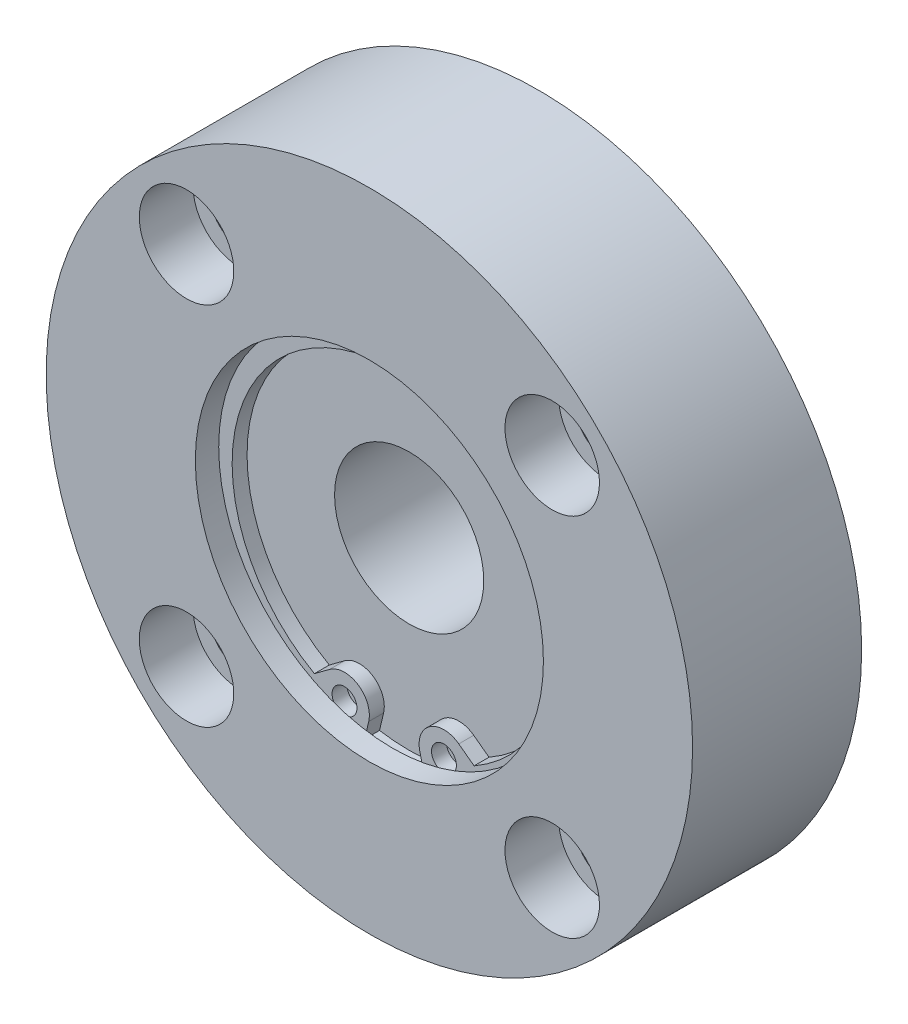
ISO-10303-21;
HEADER;
FILE_DESCRIPTION(('STEP AP214'),'2;1');
FILE_NAME('part.step','',(''),(''),'','','');
FILE_SCHEMA(('AUTOMOTIVE_DESIGN { 1 0 10303 214 1 1 1 1 }'));
ENDSEC;
DATA;
#1=APPLICATION_CONTEXT('core data for automotive mechanical design processes');
#2=APPLICATION_PROTOCOL_DEFINITION('international standard','automotive_design',2000,#1);
#3=PRODUCT_CONTEXT('',#1,'mechanical');
#4=PRODUCT('Part','Part','',(#3));
#5=PRODUCT_RELATED_PRODUCT_CATEGORY('part','',(#4));
#6=PRODUCT_DEFINITION_FORMATION('','',#4);
#7=PRODUCT_DEFINITION_CONTEXT('part definition',#1,'design');
#8=PRODUCT_DEFINITION('design','',#6,#7);
#9=PRODUCT_DEFINITION_SHAPE('','',#8);
#10=(LENGTH_UNIT() NAMED_UNIT(*) SI_UNIT(.MILLI.,.METRE.));
#11=(NAMED_UNIT(*) PLANE_ANGLE_UNIT() SI_UNIT($,.RADIAN.));
#12=(NAMED_UNIT(*) SI_UNIT($,.STERADIAN.) SOLID_ANGLE_UNIT());
#13=UNCERTAINTY_MEASURE_WITH_UNIT(LENGTH_MEASURE(1.E-05),#10,'distance_accuracy_value','');
#14=(GEOMETRIC_REPRESENTATION_CONTEXT(3) GLOBAL_UNCERTAINTY_ASSIGNED_CONTEXT((#13)) GLOBAL_UNIT_ASSIGNED_CONTEXT((#10,
#11,#12)) REPRESENTATION_CONTEXT('',''));
#15=CARTESIAN_POINT('',(0.,0.,0.));
#16=DIRECTION('',(0.,0.,1.));
#17=DIRECTION('',(1.,0.,0.));
#18=AXIS2_PLACEMENT_3D('',#15,#16,#17);
#19=CARTESIAN_POINT('',(2.5678231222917,-16.526983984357,14.6));
#20=DIRECTION('',(0.972870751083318,0.231349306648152,0.));
#21=DIRECTION('',(0.,0.,-1.));
#22=AXIS2_PLACEMENT_3D('',#19,#20,#21);
#23=PLANE('',#22);
#24=DIRECTION('',(0.231349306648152,-0.972870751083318,0.));
#25=VECTOR('',#24,1.);
#26=CARTESIAN_POINT('',(2.5678231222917,-16.526983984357,13.));
#27=LINE('',#26,#25);
#28=CARTESIAN_POINT('',(2.5678231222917,-16.526983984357,13.));
#29=VERTEX_POINT('',#28);
#30=CARTESIAN_POINT('',(2.97957431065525,-18.2584812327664,13.));
#31=VERTEX_POINT('',#30);
#32=EDGE_CURVE('E28',#29,#31,#27,.T.);
#33=ORIENTED_EDGE('',*,*,#32,.T.);
#34=DIRECTION('',(0.,0.,-1.));
#35=VECTOR('',#34,1.);
#36=CARTESIAN_POINT('',(2.97957431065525,-18.2584812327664,14.65));
#37=LINE('',#36,#35);
#38=CARTESIAN_POINT('',(2.97957431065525,-18.2584812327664,14.5));
#39=VERTEX_POINT('',#38);
#40=EDGE_CURVE('E9',#31,#39,#37,.F.);
#41=ORIENTED_EDGE('',*,*,#40,.T.);
#42=DIRECTION('',(0.231349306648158,-0.972870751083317,0.));
#43=VECTOR('',#42,1.);
#44=CARTESIAN_POINT('',(2.56782312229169,-16.526983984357,14.5));
#45=LINE('',#44,#43);
#46=CARTESIAN_POINT('',(2.56782312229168,-16.526983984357,14.5));
#47=VERTEX_POINT('',#46);
#48=EDGE_CURVE('E239',#47,#39,#45,.T.);
#49=ORIENTED_EDGE('',*,*,#48,.F.);
#50=DIRECTION('',(0.,0.,-1.));
#51=VECTOR('',#50,1.);
#52=CARTESIAN_POINT('',(2.5678231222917,-16.526983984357,14.6));
#53=LINE('',#52,#51);
#54=EDGE_CURVE('E129',#47,#29,#53,.T.);
#55=ORIENTED_EDGE('',*,*,#54,.T.);
#56=EDGE_LOOP('',(#33,#41,#49,#55));
#57=FACE_BOUND('',#56,.T.);
#58=ADVANCED_FACE('F14',(#57),#23,.F.);
#59=CARTESIAN_POINT('',(5.,-15.9486107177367,14.6));
#60=DIRECTION('',(0.,0.,1.));
#61=DIRECTION('',(-1.,0.,0.));
#62=AXIS2_PLACEMENT_3D('',#59,#60,#61);
#63=CYLINDRICAL_SURFACE('',#62,2.5);
#64=ORIENTED_EDGE('',*,*,#54,.F.);
#65=CARTESIAN_POINT('',(5.,-15.9486107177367,14.5));
#66=DIRECTION('',(0.,0.,1.));
#67=DIRECTION('',(1.,0.,0.));
#68=AXIS2_PLACEMENT_3D('',#65,#66,#67);
#69=CIRCLE('',#68,2.5);
#70=CARTESIAN_POINT('',(6.49138441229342,-13.9421779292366,14.5));
#71=VERTEX_POINT('',#70);
#72=EDGE_CURVE('E243',#71,#47,#69,.T.);
#73=ORIENTED_EDGE('',*,*,#72,.F.);
#74=DIRECTION('',(0.,0.,-1.));
#75=VECTOR('',#74,1.);
#76=CARTESIAN_POINT('',(6.49138441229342,-13.9421779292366,14.6));
#77=LINE('',#76,#75);
#78=CARTESIAN_POINT('',(6.49138441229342,-13.9421779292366,13.));
#79=VERTEX_POINT('',#78);
#80=EDGE_CURVE('E144',#71,#79,#77,.T.);
#81=ORIENTED_EDGE('',*,*,#80,.T.);
#82=CARTESIAN_POINT('',(5.,-15.9486107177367,13.));
#83=DIRECTION('',(0.,0.,1.));
#84=DIRECTION('',(1.,0.,0.));
#85=AXIS2_PLACEMENT_3D('',#82,#83,#84);
#86=CIRCLE('',#85,2.5);
#87=EDGE_CURVE('E141',#79,#29,#86,.T.);
#88=ORIENTED_EDGE('',*,*,#87,.T.);
#89=EDGE_LOOP('',(#64,#73,#81,#88));
#90=FACE_BOUND('',#89,.T.);
#91=ADVANCED_FACE('F242',(#90),#63,.T.);
#92=CARTESIAN_POINT('',(6.49138441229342,-13.9421779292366,14.6));
#93=DIRECTION('',(-0.596553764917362,-0.802573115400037,0.));
#94=DIRECTION('',(-0.802573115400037,0.596553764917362,0.));
#95=AXIS2_PLACEMENT_3D('',#92,#93,#94);
#96=PLANE('',#95);
#97=DIRECTION('',(-0.802573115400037,0.596553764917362,0.));
#98=VECTOR('',#97,1.);
#99=CARTESIAN_POINT('',(8.02922574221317,-15.0852576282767,14.5));
#100=LINE('',#99,#98);
#101=CARTESIAN_POINT('',(8.02922574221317,-15.0852576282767,14.5));
#102=VERTEX_POINT('',#101);
#103=EDGE_CURVE('E271',#102,#71,#100,.T.);
#104=ORIENTED_EDGE('',*,*,#103,.F.);
#105=DIRECTION('',(0.,0.,-1.));
#106=VECTOR('',#105,1.);
#107=CARTESIAN_POINT('',(8.02922574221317,-15.0852576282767,14.6));
#108=LINE('',#107,#106);
#109=CARTESIAN_POINT('',(8.02922574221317,-15.0852576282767,13.));
#110=VERTEX_POINT('',#109);
#111=EDGE_CURVE('E140',#102,#110,#108,.T.);
#112=ORIENTED_EDGE('',*,*,#111,.T.);
#113=DIRECTION('',(-0.802573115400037,0.596553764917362,0.));
#114=VECTOR('',#113,1.);
#115=CARTESIAN_POINT('',(6.49138441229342,-13.9421779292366,13.));
#116=LINE('',#115,#114);
#117=EDGE_CURVE('E137',#110,#79,#116,.T.);
#118=ORIENTED_EDGE('',*,*,#117,.T.);
#119=ORIENTED_EDGE('',*,*,#80,.F.);
#120=EDGE_LOOP('',(#104,#112,#118,#119));
#121=FACE_BOUND('',#120,.T.);
#122=ADVANCED_FACE('F270',(#121),#96,.F.);
#123=CARTESIAN_POINT('',(0.,-0.9,14.6));
#124=DIRECTION('',(0.,0.,1.));
#125=DIRECTION('',(-1.,0.,0.));
#126=AXIS2_PLACEMENT_3D('',#123,#124,#125);
#127=CYLINDRICAL_SURFACE('',#126,16.3);
#128=CARTESIAN_POINT('',(0.,-0.9,14.5));
#129=DIRECTION('',(0.,0.,-1.));
#130=DIRECTION('',(1.,0.,0.));
#131=AXIS2_PLACEMENT_3D('',#128,#129,#130);
#132=CIRCLE('',#131,16.3);
#133=CARTESIAN_POINT('',(-8.02922574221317,-15.0852576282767,14.5));
#134=VERTEX_POINT('',#133);
#135=EDGE_CURVE('E106',#134,#102,#132,.T.);
#136=ORIENTED_EDGE('',*,*,#135,.F.);
#137=DIRECTION('',(0.,0.,-1.));
#138=VECTOR('',#137,1.);
#139=CARTESIAN_POINT('',(-8.02922574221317,-15.0852576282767,14.6));
#140=LINE('',#139,#138);
#141=CARTESIAN_POINT('',(-8.02922574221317,-15.0852576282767,13.));
#142=VERTEX_POINT('',#141);
#143=EDGE_CURVE('E105',#134,#142,#140,.T.);
#144=ORIENTED_EDGE('',*,*,#143,.T.);
#145=CARTESIAN_POINT('',(0.,-0.9,13.));
#146=DIRECTION('',(0.,0.,-1.));
#147=DIRECTION('',(0.,-1.,0.));
#148=AXIS2_PLACEMENT_3D('',#145,#146,#147);
#149=CIRCLE('',#148,16.3);
#150=EDGE_CURVE('E124',#142,#110,#149,.T.);
#151=ORIENTED_EDGE('',*,*,#150,.T.);
#152=ORIENTED_EDGE('',*,*,#111,.F.);
#153=EDGE_LOOP('',(#136,#144,#151,#152));
#154=FACE_BOUND('',#153,.T.);
#155=ADVANCED_FACE('F269',(#154),#127,.F.);
#156=CARTESIAN_POINT('',(-6.49138441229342,-13.9421779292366,14.6));
#157=DIRECTION('',(0.596553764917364,-0.802573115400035,0.));
#158=DIRECTION('',(0.,0.,-1.));
#159=AXIS2_PLACEMENT_3D('',#156,#157,#158);
#160=PLANE('',#159);
#161=DIRECTION('',(-0.802573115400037,-0.596553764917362,0.));
#162=VECTOR('',#161,1.);
#163=CARTESIAN_POINT('',(-6.49138441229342,-13.9421779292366,14.5));
#164=LINE('',#163,#162);
#165=CARTESIAN_POINT('',(-6.49138441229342,-13.9421779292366,14.5));
#166=VERTEX_POINT('',#165);
#167=EDGE_CURVE('E89',#166,#134,#164,.T.);
#168=ORIENTED_EDGE('',*,*,#167,.F.);
#169=DIRECTION('',(0.,0.,-1.));
#170=VECTOR('',#169,1.);
#171=CARTESIAN_POINT('',(-6.49138441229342,-13.9421779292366,14.6));
#172=LINE('',#171,#170);
#173=CARTESIAN_POINT('',(-6.49138441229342,-13.9421779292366,13.));
#174=VERTEX_POINT('',#173);
#175=EDGE_CURVE('E103',#166,#174,#172,.T.);
#176=ORIENTED_EDGE('',*,*,#175,.T.);
#177=DIRECTION('',(-0.802573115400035,-0.596553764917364,0.));
#178=VECTOR('',#177,1.);
#179=CARTESIAN_POINT('',(-6.49138441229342,-13.9421779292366,13.));
#180=LINE('',#179,#178);
#181=EDGE_CURVE('E112',#174,#142,#180,.T.);
#182=ORIENTED_EDGE('',*,*,#181,.T.);
#183=ORIENTED_EDGE('',*,*,#143,.F.);
#184=EDGE_LOOP('',(#168,#176,#182,#183));
#185=FACE_BOUND('',#184,.T.);
#186=ADVANCED_FACE('F102',(#185),#160,.F.);
#187=CARTESIAN_POINT('',(-5.,-15.9486107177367,14.6));
#188=DIRECTION('',(0.,0.,1.));
#189=DIRECTION('',(-1.,0.,0.));
#190=AXIS2_PLACEMENT_3D('',#187,#188,#189);
#191=CYLINDRICAL_SURFACE('',#190,2.5);
#192=ORIENTED_EDGE('',*,*,#175,.F.);
#193=CARTESIAN_POINT('',(-5.,-15.9486107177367,14.5));
#194=DIRECTION('',(0.,0.,1.));
#195=DIRECTION('',(1.,0.,0.));
#196=AXIS2_PLACEMENT_3D('',#193,#194,#195);
#197=CIRCLE('',#196,2.5);
#198=CARTESIAN_POINT('',(-2.56782312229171,-16.526983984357,14.5));
#199=VERTEX_POINT('',#198);
#200=EDGE_CURVE('E86',#199,#166,#197,.T.);
#201=ORIENTED_EDGE('',*,*,#200,.F.);
#202=DIRECTION('',(0.,0.,-1.));
#203=VECTOR('',#202,1.);
#204=CARTESIAN_POINT('',(-2.56782312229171,-16.526983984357,14.6));
#205=LINE('',#204,#203);
#206=CARTESIAN_POINT('',(-2.56782312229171,-16.526983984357,13.));
#207=VERTEX_POINT('',#206);
#208=EDGE_CURVE('E132',#199,#207,#205,.T.);
#209=ORIENTED_EDGE('',*,*,#208,.T.);
#210=CARTESIAN_POINT('',(-5.,-15.9486107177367,13.));
#211=DIRECTION('',(0.,0.,1.));
#212=DIRECTION('',(-1.,0.,0.));
#213=AXIS2_PLACEMENT_3D('',#210,#211,#212);
#214=CIRCLE('',#213,2.5);
#215=EDGE_CURVE('E109',#207,#174,#214,.T.);
#216=ORIENTED_EDGE('',*,*,#215,.T.);
#217=EDGE_LOOP('',(#192,#201,#209,#216));
#218=FACE_BOUND('',#217,.T.);
#219=ADVANCED_FACE('F108',(#218),#191,.T.);
#220=CARTESIAN_POINT('',(-2.56782312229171,-16.526983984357,14.6));
#221=DIRECTION('',(-0.97287075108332,0.231349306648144,0.));
#222=DIRECTION('',(0.,0.,1.));
#223=AXIS2_PLACEMENT_3D('',#220,#221,#222);
#224=PLANE('',#223);
#225=DIRECTION('',(0.231349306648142,0.972870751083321,0.));
#226=VECTOR('',#225,1.);
#227=CARTESIAN_POINT('',(-3.07234735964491,-18.6486107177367,14.5));
#228=LINE('',#227,#226);
#229=CARTESIAN_POINT('',(-2.97957431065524,-18.2584812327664,14.5));
#230=VERTEX_POINT('',#229);
#231=EDGE_CURVE('E92',#230,#199,#228,.T.);
#232=ORIENTED_EDGE('',*,*,#231,.F.);
#233=DIRECTION('',(0.,0.,-1.));
#234=VECTOR('',#233,1.);
#235=CARTESIAN_POINT('',(-2.97957431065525,-18.2584812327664,14.65));
#236=LINE('',#235,#234);
#237=CARTESIAN_POINT('',(-2.97957431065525,-18.2584812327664,13.));
#238=VERTEX_POINT('',#237);
#239=EDGE_CURVE('E22',#230,#238,#236,.T.);
#240=ORIENTED_EDGE('',*,*,#239,.T.);
#241=DIRECTION('',(0.231349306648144,0.97287075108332,0.));
#242=VECTOR('',#241,1.);
#243=CARTESIAN_POINT('',(-2.56782312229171,-16.526983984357,13.));
#244=LINE('',#243,#242);
#245=EDGE_CURVE('E36',#238,#207,#244,.T.);
#246=ORIENTED_EDGE('',*,*,#245,.T.);
#247=ORIENTED_EDGE('',*,*,#208,.F.);
#248=EDGE_LOOP('',(#232,#240,#246,#247));
#249=FACE_BOUND('',#248,.T.);
#250=ADVANCED_FACE('F228',(#249),#224,.F.);
#251=CARTESIAN_POINT('',(5.,-15.9486107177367,14.6));
#252=DIRECTION('',(0.,0.,1.));
#253=DIRECTION('',(-1.,0.,0.));
#254=AXIS2_PLACEMENT_3D('',#251,#252,#253);
#255=CYLINDRICAL_SURFACE('',#254,1.25);
#256=CARTESIAN_POINT('',(5.,-15.9486107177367,13.));
#257=DIRECTION('',(0.,0.,1.));
#258=DIRECTION('',(1.,0.,0.));
#259=AXIS2_PLACEMENT_3D('',#256,#257,#258);
#260=CIRCLE('',#259,1.25);
#261=CARTESIAN_POINT('',(6.25,-15.9486107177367,13.));
#262=VERTEX_POINT('',#261);
#263=EDGE_CURVE('E113',#262,#262,#260,.T.);
#264=ORIENTED_EDGE('',*,*,#263,.F.);
#265=EDGE_LOOP('',(#264));
#266=FACE_BOUND('',#265,.T.);
#267=CARTESIAN_POINT('',(5.,-15.9486107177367,14.5));
#268=DIRECTION('',(0.,0.,1.));
#269=DIRECTION('',(1.,0.,0.));
#270=AXIS2_PLACEMENT_3D('',#267,#268,#269);
#271=CIRCLE('',#270,1.25);
#272=CARTESIAN_POINT('',(6.25,-15.9486107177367,14.5));
#273=VERTEX_POINT('',#272);
#274=EDGE_CURVE('E145',#273,#273,#271,.F.);
#275=ORIENTED_EDGE('',*,*,#274,.F.);
#276=EDGE_LOOP('',(#275));
#277=FACE_BOUND('',#276,.T.);
#278=ADVANCED_FACE('F332',(#266,#277),#255,.F.);
#279=CARTESIAN_POINT('',(-5.,-15.9486107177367,14.6));
#280=DIRECTION('',(0.,0.,1.));
#281=DIRECTION('',(-1.,0.,0.));
#282=AXIS2_PLACEMENT_3D('',#279,#280,#281);
#283=CYLINDRICAL_SURFACE('',#282,1.25);
#284=CARTESIAN_POINT('',(-5.,-15.9486107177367,13.));
#285=DIRECTION('',(0.,0.,-1.));
#286=DIRECTION('',(1.,0.,0.));
#287=AXIS2_PLACEMENT_3D('',#284,#285,#286);
#288=CIRCLE('',#287,1.25);
#289=CARTESIAN_POINT('',(-3.75,-15.9486107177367,13.));
#290=VERTEX_POINT('',#289);
#291=EDGE_CURVE('E133',#290,#290,#288,.T.);
#292=ORIENTED_EDGE('',*,*,#291,.T.);
#293=EDGE_LOOP('',(#292));
#294=FACE_BOUND('',#293,.T.);
#295=CARTESIAN_POINT('',(-5.,-15.9486107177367,14.5));
#296=DIRECTION('',(0.,0.,1.));
#297=DIRECTION('',(1.,0.,0.));
#298=AXIS2_PLACEMENT_3D('',#295,#296,#297);
#299=CIRCLE('',#298,1.25);
#300=CARTESIAN_POINT('',(-3.75,-15.9486107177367,14.5));
#301=VERTEX_POINT('',#300);
#302=EDGE_CURVE('E148',#301,#301,#299,.F.);
#303=ORIENTED_EDGE('',*,*,#302,.F.);
#304=EDGE_LOOP('',(#303));
#305=FACE_BOUND('',#304,.T.);
#306=ADVANCED_FACE('F347',(#294,#305),#283,.F.);
#307=CARTESIAN_POINT('',(-5.,-15.9486107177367,14.5));
#308=DIRECTION('',(0.,0.,1.));
#309=DIRECTION('',(1.,0.,0.));
#310=AXIS2_PLACEMENT_3D('',#307,#308,#309);
#311=PLANE('',#310);
#312=ORIENTED_EDGE('',*,*,#302,.T.);
#313=EDGE_LOOP('',(#312));
#314=FACE_BOUND('',#313,.T.);
#315=ORIENTED_EDGE('',*,*,#274,.T.);
#316=EDGE_LOOP('',(#315));
#317=FACE_BOUND('',#316,.T.);
#318=CARTESIAN_POINT('',(0.,0.,14.5));
#319=DIRECTION('',(0.,0.,1.));
#320=DIRECTION('',(1.,0.,0.));
#321=AXIS2_PLACEMENT_3D('',#318,#319,#320);
#322=CIRCLE('',#321,18.5);
#323=EDGE_CURVE('E120',#230,#39,#322,.F.);
#324=ORIENTED_EDGE('',*,*,#323,.F.);
#325=ORIENTED_EDGE('',*,*,#231,.T.);
#326=ORIENTED_EDGE('',*,*,#200,.T.);
#327=ORIENTED_EDGE('',*,*,#167,.T.);
#328=ORIENTED_EDGE('',*,*,#135,.T.);
#329=ORIENTED_EDGE('',*,*,#103,.T.);
#330=ORIENTED_EDGE('',*,*,#72,.T.);
#331=ORIENTED_EDGE('',*,*,#48,.T.);
#332=EDGE_LOOP('',(#324,#325,#326,#327,#328,#329,#330,#331));
#333=FACE_BOUND('',#332,.T.);
#334=ADVANCED_FACE('F88',(#314,#317,#333),#311,.T.);
#335=CARTESIAN_POINT('',(18.3847763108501,18.3847763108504,0.));
#336=DIRECTION('',(0.,0.,1.));
#337=DIRECTION('',(1.,0.,0.));
#338=AXIS2_PLACEMENT_3D('',#335,#336,#337);
#339=CYLINDRICAL_SURFACE('',#338,3.);
#340=CARTESIAN_POINT('',(18.3847763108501,18.3847763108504,0.));
#341=DIRECTION('',(0.,0.,1.));
#342=DIRECTION('',(1.,0.,0.));
#343=AXIS2_PLACEMENT_3D('',#340,#341,#342);
#344=CIRCLE('',#343,3.);
#345=CARTESIAN_POINT('',(21.3847763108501,18.3847763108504,0.));
#346=VERTEX_POINT('',#345);
#347=EDGE_CURVE('E204',#346,#346,#344,.T.);
#348=ORIENTED_EDGE('',*,*,#347,.F.);
#349=EDGE_LOOP('',(#348));
#350=FACE_BOUND('',#349,.T.);
#351=CARTESIAN_POINT('',(18.3847763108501,18.3847763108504,11.6));
#352=DIRECTION('',(0.,0.,1.));
#353=DIRECTION('',(1.,0.,0.));
#354=AXIS2_PLACEMENT_3D('',#351,#352,#353);
#355=CIRCLE('',#354,3.);
#356=CARTESIAN_POINT('',(21.3847763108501,18.3847763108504,11.6));
#357=VERTEX_POINT('',#356);
#358=EDGE_CURVE('E203',#357,#357,#355,.F.);
#359=ORIENTED_EDGE('',*,*,#358,.F.);
#360=EDGE_LOOP('',(#359));
#361=FACE_BOUND('',#360,.T.);
#362=ADVANCED_FACE('F371',(#350,#361),#339,.F.);
#363=CARTESIAN_POINT('',(18.3847763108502,-18.3847763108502,0.));
#364=DIRECTION('',(0.,0.,1.));
#365=DIRECTION('',(1.,0.,0.));
#366=AXIS2_PLACEMENT_3D('',#363,#364,#365);
#367=CYLINDRICAL_SURFACE('',#366,3.);
#368=CARTESIAN_POINT('',(18.3847763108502,-18.3847763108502,0.));
#369=DIRECTION('',(0.,0.,1.));
#370=DIRECTION('',(0.,-1.,0.));
#371=AXIS2_PLACEMENT_3D('',#368,#369,#370);
#372=CIRCLE('',#371,3.);
#373=CARTESIAN_POINT('',(18.3847763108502,-21.3847763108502,0.));
#374=VERTEX_POINT('',#373);
#375=EDGE_CURVE('E194',#374,#374,#372,.T.);
#376=ORIENTED_EDGE('',*,*,#375,.F.);
#377=EDGE_LOOP('',(#376));
#378=FACE_BOUND('',#377,.T.);
#379=CARTESIAN_POINT('',(18.3847763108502,-18.3847763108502,11.6));
#380=DIRECTION('',(0.,0.,1.));
#381=DIRECTION('',(1.,0.,0.));
#382=AXIS2_PLACEMENT_3D('',#379,#380,#381);
#383=CIRCLE('',#382,3.);
#384=CARTESIAN_POINT('',(21.3847763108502,-18.3847763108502,11.6));
#385=VERTEX_POINT('',#384);
#386=EDGE_CURVE('E187',#385,#385,#383,.F.);
#387=ORIENTED_EDGE('',*,*,#386,.F.);
#388=EDGE_LOOP('',(#387));
#389=FACE_BOUND('',#388,.T.);
#390=ADVANCED_FACE('F381',(#378,#389),#367,.F.);
#391=CARTESIAN_POINT('',(-18.3847763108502,-18.3847763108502,0.));
#392=DIRECTION('',(0.,0.,1.));
#393=DIRECTION('',(1.,0.,0.));
#394=AXIS2_PLACEMENT_3D('',#391,#392,#393);
#395=CYLINDRICAL_SURFACE('',#394,3.);
#396=CARTESIAN_POINT('',(-18.3847763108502,-18.3847763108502,0.));
#397=DIRECTION('',(0.,0.,1.));
#398=DIRECTION('',(-1.,0.,0.));
#399=AXIS2_PLACEMENT_3D('',#396,#397,#398);
#400=CIRCLE('',#399,3.);
#401=CARTESIAN_POINT('',(-21.3847763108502,-18.3847763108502,0.));
#402=VERTEX_POINT('',#401);
#403=EDGE_CURVE('E191',#402,#402,#400,.T.);
#404=ORIENTED_EDGE('',*,*,#403,.F.);
#405=EDGE_LOOP('',(#404));
#406=FACE_BOUND('',#405,.T.);
#407=CARTESIAN_POINT('',(-18.3847763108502,-18.3847763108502,11.6));
#408=DIRECTION('',(0.,0.,1.));
#409=DIRECTION('',(1.,0.,0.));
#410=AXIS2_PLACEMENT_3D('',#407,#408,#409);
#411=CIRCLE('',#410,3.);
#412=CARTESIAN_POINT('',(-15.3847763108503,-18.3847763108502,11.6));
#413=VERTEX_POINT('',#412);
#414=EDGE_CURVE('E180',#413,#413,#411,.F.);
#415=ORIENTED_EDGE('',*,*,#414,.F.);
#416=EDGE_LOOP('',(#415));
#417=FACE_BOUND('',#416,.T.);
#418=ADVANCED_FACE('F390',(#406,#417),#395,.F.);
#419=CARTESIAN_POINT('',(-18.3847763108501,18.3847763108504,0.));
#420=DIRECTION('',(0.,0.,1.));
#421=DIRECTION('',(1.,0.,0.));
#422=AXIS2_PLACEMENT_3D('',#419,#420,#421);
#423=CYLINDRICAL_SURFACE('',#422,3.);
#424=CARTESIAN_POINT('',(-18.3847763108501,18.3847763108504,0.));
#425=DIRECTION('',(0.,0.,1.));
#426=DIRECTION('',(0.,1.,0.));
#427=AXIS2_PLACEMENT_3D('',#424,#425,#426);
#428=CIRCLE('',#427,3.);
#429=CARTESIAN_POINT('',(-18.3847763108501,21.3847763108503,0.));
#430=VERTEX_POINT('',#429);
#431=EDGE_CURVE('E188',#430,#430,#428,.T.);
#432=ORIENTED_EDGE('',*,*,#431,.F.);
#433=EDGE_LOOP('',(#432));
#434=FACE_BOUND('',#433,.T.);
#435=CARTESIAN_POINT('',(-18.3847763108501,18.3847763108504,11.6));
#436=DIRECTION('',(0.,0.,1.));
#437=DIRECTION('',(1.,0.,0.));
#438=AXIS2_PLACEMENT_3D('',#435,#436,#437);
#439=CIRCLE('',#438,3.);
#440=CARTESIAN_POINT('',(-15.3847763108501,18.3847763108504,11.6));
#441=VERTEX_POINT('',#440);
#442=EDGE_CURVE('E173',#441,#441,#439,.F.);
#443=ORIENTED_EDGE('',*,*,#442,.F.);
#444=EDGE_LOOP('',(#443));
#445=FACE_BOUND('',#444,.T.);
#446=ADVANCED_FACE('F399',(#434,#445),#423,.F.);
#447=CARTESIAN_POINT('',(18.3847763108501,18.3847763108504,11.6));
#448=DIRECTION('',(0.,0.,1.));
#449=DIRECTION('',(1.,0.,0.));
#450=AXIS2_PLACEMENT_3D('',#447,#448,#449);
#451=PLANE('',#450);
#452=CARTESIAN_POINT('',(18.3847763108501,18.3847763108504,11.6));
#453=DIRECTION('',(0.,0.,1.));
#454=DIRECTION('',(1.,0.,0.));
#455=AXIS2_PLACEMENT_3D('',#452,#453,#454);
#456=CIRCLE('',#455,4.75);
#457=CARTESIAN_POINT('',(23.1347763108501,18.3847763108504,11.6));
#458=VERTEX_POINT('',#457);
#459=EDGE_CURVE('E200',#458,#458,#456,.T.);
#460=ORIENTED_EDGE('',*,*,#459,.T.);
#461=EDGE_LOOP('',(#460));
#462=FACE_BOUND('',#461,.T.);
#463=ORIENTED_EDGE('',*,*,#358,.T.);
#464=EDGE_LOOP('',(#463));
#465=FACE_BOUND('',#464,.T.);
#466=ADVANCED_FACE('F408',(#462,#465),#451,.T.);
#467=CARTESIAN_POINT('',(18.3847763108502,-18.3847763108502,11.6));
#468=DIRECTION('',(0.,0.,1.));
#469=DIRECTION('',(0.,-1.,0.));
#470=AXIS2_PLACEMENT_3D('',#467,#468,#469);
#471=PLANE('',#470);
#472=CARTESIAN_POINT('',(18.3847763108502,-18.3847763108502,11.6));
#473=DIRECTION('',(0.,0.,1.));
#474=DIRECTION('',(0.,-1.,0.));
#475=AXIS2_PLACEMENT_3D('',#472,#473,#474);
#476=CIRCLE('',#475,4.75);
#477=CARTESIAN_POINT('',(18.3847763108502,-23.1347763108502,11.6));
#478=VERTEX_POINT('',#477);
#479=EDGE_CURVE('E184',#478,#478,#476,.T.);
#480=ORIENTED_EDGE('',*,*,#479,.T.);
#481=EDGE_LOOP('',(#480));
#482=FACE_BOUND('',#481,.T.);
#483=ORIENTED_EDGE('',*,*,#386,.T.);
#484=EDGE_LOOP('',(#483));
#485=FACE_BOUND('',#484,.T.);
#486=ADVANCED_FACE('F417',(#482,#485),#471,.T.);
#487=CARTESIAN_POINT('',(-18.3847763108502,-18.3847763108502,11.6));
#488=DIRECTION('',(0.,0.,1.));
#489=DIRECTION('',(-1.,0.,0.));
#490=AXIS2_PLACEMENT_3D('',#487,#488,#489);
#491=PLANE('',#490);
#492=CARTESIAN_POINT('',(-18.3847763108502,-18.3847763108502,11.6));
#493=DIRECTION('',(0.,0.,1.));
#494=DIRECTION('',(-1.,0.,0.));
#495=AXIS2_PLACEMENT_3D('',#492,#493,#494);
#496=CIRCLE('',#495,4.75);
#497=CARTESIAN_POINT('',(-23.1347763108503,-18.3847763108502,11.6));
#498=VERTEX_POINT('',#497);
#499=EDGE_CURVE('E177',#498,#498,#496,.T.);
#500=ORIENTED_EDGE('',*,*,#499,.T.);
#501=EDGE_LOOP('',(#500));
#502=FACE_BOUND('',#501,.T.);
#503=ORIENTED_EDGE('',*,*,#414,.T.);
#504=EDGE_LOOP('',(#503));
#505=FACE_BOUND('',#504,.T.);
#506=ADVANCED_FACE('F426',(#502,#505),#491,.T.);
#507=CARTESIAN_POINT('',(-18.3847763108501,18.3847763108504,11.6));
#508=DIRECTION('',(0.,0.,1.));
#509=DIRECTION('',(0.,1.,0.));
#510=AXIS2_PLACEMENT_3D('',#507,#508,#509);
#511=PLANE('',#510);
#512=CARTESIAN_POINT('',(-18.3847763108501,18.3847763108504,11.6));
#513=DIRECTION('',(0.,0.,1.));
#514=DIRECTION('',(0.,1.,0.));
#515=AXIS2_PLACEMENT_3D('',#512,#513,#514);
#516=CIRCLE('',#515,4.75);
#517=CARTESIAN_POINT('',(-18.3847763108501,23.1347763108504,11.6));
#518=VERTEX_POINT('',#517);
#519=EDGE_CURVE('E170',#518,#518,#516,.T.);
#520=ORIENTED_EDGE('',*,*,#519,.T.);
#521=EDGE_LOOP('',(#520));
#522=FACE_BOUND('',#521,.T.);
#523=ORIENTED_EDGE('',*,*,#442,.T.);
#524=EDGE_LOOP('',(#523));
#525=FACE_BOUND('',#524,.T.);
#526=ADVANCED_FACE('F435',(#522,#525),#511,.T.);
#527=CARTESIAN_POINT('',(0.,0.,0.));
#528=DIRECTION('',(0.,0.,1.));
#529=DIRECTION('',(1.,0.,0.));
#530=AXIS2_PLACEMENT_3D('',#527,#528,#529);
#531=PLANE('',#530);
#532=CARTESIAN_POINT('',(0.,0.,0.));
#533=DIRECTION('',(0.,0.,-1.));
#534=DIRECTION('',(-1.,0.,0.));
#535=AXIS2_PLACEMENT_3D('',#532,#533,#534);
#536=CIRCLE('',#535,14.5);
#537=CARTESIAN_POINT('',(-14.5,0.,0.));
#538=VERTEX_POINT('',#537);
#539=EDGE_CURVE('E156',#538,#538,#536,.T.);
#540=ORIENTED_EDGE('',*,*,#539,.F.);
#541=EDGE_LOOP('',(#540));
#542=FACE_BOUND('',#541,.T.);
#543=ORIENTED_EDGE('',*,*,#431,.T.);
#544=EDGE_LOOP('',(#543));
#545=FACE_BOUND('',#544,.T.);
#546=ORIENTED_EDGE('',*,*,#403,.T.);
#547=EDGE_LOOP('',(#546));
#548=FACE_BOUND('',#547,.T.);
#549=ORIENTED_EDGE('',*,*,#375,.T.);
#550=EDGE_LOOP('',(#549));
#551=FACE_BOUND('',#550,.T.);
#552=ORIENTED_EDGE('',*,*,#347,.T.);
#553=EDGE_LOOP('',(#552));
#554=FACE_BOUND('',#553,.T.);
#555=CARTESIAN_POINT('',(0.,0.,0.));
#556=DIRECTION('',(0.,0.,1.));
#557=DIRECTION('',(1.,0.,0.));
#558=AXIS2_PLACEMENT_3D('',#555,#556,#557);
#559=CIRCLE('',#558,32.5);
#560=CARTESIAN_POINT('',(32.5,0.,0.));
#561=VERTEX_POINT('',#560);
#562=EDGE_CURVE('E207',#561,#561,#559,.T.);
#563=ORIENTED_EDGE('',*,*,#562,.F.);
#564=EDGE_LOOP('',(#563));
#565=FACE_BOUND('',#564,.T.);
#566=ADVANCED_FACE('F444',(#542,#545,#548,#551,#554,#565),#531,.F.);
#567=CARTESIAN_POINT('',(0.,0.,17.));
#568=DIRECTION('',(0.,0.,-1.));
#569=DIRECTION('',(-1.,0.,0.));
#570=AXIS2_PLACEMENT_3D('',#567,#568,#569);
#571=CYLINDRICAL_SURFACE('',#570,32.5);
#572=CARTESIAN_POINT('',(0.,0.,17.));
#573=DIRECTION('',(0.,0.,1.));
#574=DIRECTION('',(1.,0.,0.));
#575=AXIS2_PLACEMENT_3D('',#572,#573,#574);
#576=CIRCLE('',#575,32.5);
#577=CARTESIAN_POINT('',(32.5,0.,17.));
#578=VERTEX_POINT('',#577);
#579=EDGE_CURVE('E97',#578,#578,#576,.T.);
#580=ORIENTED_EDGE('',*,*,#579,.F.);
#581=EDGE_LOOP('',(#580));
#582=FACE_BOUND('',#581,.T.);
#583=ORIENTED_EDGE('',*,*,#562,.T.);
#584=EDGE_LOOP('',(#583));
#585=FACE_BOUND('',#584,.T.);
#586=ADVANCED_FACE('F16',(#582,#585),#571,.T.);
#587=CARTESIAN_POINT('',(18.3847763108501,18.3847763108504,11.6));
#588=DIRECTION('',(0.,0.,1.));
#589=DIRECTION('',(1.,0.,0.));
#590=AXIS2_PLACEMENT_3D('',#587,#588,#589);
#591=CYLINDRICAL_SURFACE('',#590,4.75);
#592=ORIENTED_EDGE('',*,*,#459,.F.);
#593=EDGE_LOOP('',(#592));
#594=FACE_BOUND('',#593,.T.);
#595=CARTESIAN_POINT('',(18.3847763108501,18.3847763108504,17.));
#596=DIRECTION('',(0.,0.,1.));
#597=DIRECTION('',(1.,0.,0.));
#598=AXIS2_PLACEMENT_3D('',#595,#596,#597);
#599=CIRCLE('',#598,4.75);
#600=CARTESIAN_POINT('',(23.1347763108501,18.3847763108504,17.));
#601=VERTEX_POINT('',#600);
#602=EDGE_CURVE('E197',#601,#601,#599,.T.);
#603=ORIENTED_EDGE('',*,*,#602,.T.);
#604=EDGE_LOOP('',(#603));
#605=FACE_BOUND('',#604,.T.);
#606=ADVANCED_FACE('F461',(#594,#605),#591,.F.);
#607=CARTESIAN_POINT('',(18.3847763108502,-18.3847763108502,11.6));
#608=DIRECTION('',(0.,0.,1.));
#609=DIRECTION('',(1.,0.,0.));
#610=AXIS2_PLACEMENT_3D('',#607,#608,#609);
#611=CYLINDRICAL_SURFACE('',#610,4.75);
#612=ORIENTED_EDGE('',*,*,#479,.F.);
#613=EDGE_LOOP('',(#612));
#614=FACE_BOUND('',#613,.T.);
#615=CARTESIAN_POINT('',(18.3847763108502,-18.3847763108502,17.));
#616=DIRECTION('',(0.,0.,1.));
#617=DIRECTION('',(0.,-1.,0.));
#618=AXIS2_PLACEMENT_3D('',#615,#616,#617);
#619=CIRCLE('',#618,4.75);
#620=CARTESIAN_POINT('',(18.3847763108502,-23.1347763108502,17.));
#621=VERTEX_POINT('',#620);
#622=EDGE_CURVE('E181',#621,#621,#619,.T.);
#623=ORIENTED_EDGE('',*,*,#622,.T.);
#624=EDGE_LOOP('',(#623));
#625=FACE_BOUND('',#624,.T.);
#626=ADVANCED_FACE('F469',(#614,#625),#611,.F.);
#627=CARTESIAN_POINT('',(-18.3847763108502,-18.3847763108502,11.6));
#628=DIRECTION('',(0.,0.,1.));
#629=DIRECTION('',(1.,0.,0.));
#630=AXIS2_PLACEMENT_3D('',#627,#628,#629);
#631=CYLINDRICAL_SURFACE('',#630,4.75);
#632=ORIENTED_EDGE('',*,*,#499,.F.);
#633=EDGE_LOOP('',(#632));
#634=FACE_BOUND('',#633,.T.);
#635=CARTESIAN_POINT('',(-18.3847763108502,-18.3847763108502,17.));
#636=DIRECTION('',(0.,0.,1.));
#637=DIRECTION('',(-1.,0.,0.));
#638=AXIS2_PLACEMENT_3D('',#635,#636,#637);
#639=CIRCLE('',#638,4.75);
#640=CARTESIAN_POINT('',(-23.1347763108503,-18.3847763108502,17.));
#641=VERTEX_POINT('',#640);
#642=EDGE_CURVE('E174',#641,#641,#639,.T.);
#643=ORIENTED_EDGE('',*,*,#642,.T.);
#644=EDGE_LOOP('',(#643));
#645=FACE_BOUND('',#644,.T.);
#646=ADVANCED_FACE('F478',(#634,#645),#631,.F.);
#647=CARTESIAN_POINT('',(-18.3847763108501,18.3847763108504,11.6));
#648=DIRECTION('',(0.,0.,1.));
#649=DIRECTION('',(1.,0.,0.));
#650=AXIS2_PLACEMENT_3D('',#647,#648,#649);
#651=CYLINDRICAL_SURFACE('',#650,4.75);
#652=ORIENTED_EDGE('',*,*,#519,.F.);
#653=EDGE_LOOP('',(#652));
#654=FACE_BOUND('',#653,.T.);
#655=CARTESIAN_POINT('',(-18.3847763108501,18.3847763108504,17.));
#656=DIRECTION('',(0.,0.,1.));
#657=DIRECTION('',(0.,1.,0.));
#658=AXIS2_PLACEMENT_3D('',#655,#656,#657);
#659=CIRCLE('',#658,4.75);
#660=CARTESIAN_POINT('',(-18.3847763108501,23.1347763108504,17.));
#661=VERTEX_POINT('',#660);
#662=EDGE_CURVE('E167',#661,#661,#659,.T.);
#663=ORIENTED_EDGE('',*,*,#662,.T.);
#664=EDGE_LOOP('',(#663));
#665=FACE_BOUND('',#664,.T.);
#666=ADVANCED_FACE('F487',(#654,#665),#651,.F.);
#667=CARTESIAN_POINT('',(0.,0.,2.));
#668=DIRECTION('',(0.,0.,-1.));
#669=DIRECTION('',(-1.,0.,0.));
#670=AXIS2_PLACEMENT_3D('',#667,#668,#669);
#671=CYLINDRICAL_SURFACE('',#670,14.5);
#672=CARTESIAN_POINT('',(0.,0.,2.));
#673=DIRECTION('',(0.,0.,-1.));
#674=DIRECTION('',(-1.,0.,0.));
#675=AXIS2_PLACEMENT_3D('',#672,#673,#674);
#676=CIRCLE('',#675,14.5);
#677=CARTESIAN_POINT('',(-14.5,0.,2.));
#678=VERTEX_POINT('',#677);
#679=EDGE_CURVE('E159',#678,#678,#676,.T.);
#680=ORIENTED_EDGE('',*,*,#679,.F.);
#681=EDGE_LOOP('',(#680));
#682=FACE_BOUND('',#681,.T.);
#683=ORIENTED_EDGE('',*,*,#539,.T.);
#684=EDGE_LOOP('',(#683));
#685=FACE_BOUND('',#684,.T.);
#686=ADVANCED_FACE('F496',(#682,#685),#671,.F.);
#687=CARTESIAN_POINT('',(0.,0.,17.));
#688=DIRECTION('',(0.,0.,1.));
#689=DIRECTION('',(1.,0.,0.));
#690=AXIS2_PLACEMENT_3D('',#687,#688,#689);
#691=PLANE('',#690);
#692=CARTESIAN_POINT('',(0.,0.,17.));
#693=DIRECTION('',(0.,0.,1.));
#694=DIRECTION('',(1.,0.,0.));
#695=AXIS2_PLACEMENT_3D('',#692,#693,#694);
#696=CIRCLE('',#695,17.5);
#697=CARTESIAN_POINT('',(17.5,0.,17.));
#698=VERTEX_POINT('',#697);
#699=EDGE_CURVE('E163',#698,#698,#696,.T.);
#700=ORIENTED_EDGE('',*,*,#699,.F.);
#701=EDGE_LOOP('',(#700));
#702=FACE_BOUND('',#701,.T.);
#703=ORIENTED_EDGE('',*,*,#662,.F.);
#704=EDGE_LOOP('',(#703));
#705=FACE_BOUND('',#704,.T.);
#706=ORIENTED_EDGE('',*,*,#642,.F.);
#707=EDGE_LOOP('',(#706));
#708=FACE_BOUND('',#707,.T.);
#709=ORIENTED_EDGE('',*,*,#622,.F.);
#710=EDGE_LOOP('',(#709));
#711=FACE_BOUND('',#710,.T.);
#712=ORIENTED_EDGE('',*,*,#602,.F.);
#713=EDGE_LOOP('',(#712));
#714=FACE_BOUND('',#713,.T.);
#715=ORIENTED_EDGE('',*,*,#579,.T.);
#716=EDGE_LOOP('',(#715));
#717=FACE_BOUND('',#716,.T.);
#718=ADVANCED_FACE('F505',(#702,#705,#708,#711,#714,#717),#691,.T.);
#719=CARTESIAN_POINT('',(0.,0.,2.));
#720=DIRECTION('',(0.,0.,-1.));
#721=DIRECTION('',(-1.,0.,0.));
#722=AXIS2_PLACEMENT_3D('',#719,#720,#721);
#723=PLANE('',#722);
#724=CARTESIAN_POINT('',(0.,0.,2.));
#725=DIRECTION('',(0.,0.,-1.));
#726=DIRECTION('',(-1.,0.,0.));
#727=AXIS2_PLACEMENT_3D('',#724,#725,#726);
#728=CIRCLE('',#727,7.5);
#729=CARTESIAN_POINT('',(-7.5,0.,2.));
#730=VERTEX_POINT('',#729);
#731=EDGE_CURVE('E162',#730,#730,#728,.T.);
#732=ORIENTED_EDGE('',*,*,#731,.F.);
#733=EDGE_LOOP('',(#732));
#734=FACE_BOUND('',#733,.T.);
#735=ORIENTED_EDGE('',*,*,#679,.T.);
#736=EDGE_LOOP('',(#735));
#737=FACE_BOUND('',#736,.T.);
#738=ADVANCED_FACE('F514',(#734,#737),#723,.T.);
#739=CARTESIAN_POINT('',(0.,0.,13.));
#740=DIRECTION('',(0.,0.,1.));
#741=DIRECTION('',(1.,0.,0.));
#742=AXIS2_PLACEMENT_3D('',#739,#740,#741);
#743=CYLINDRICAL_SURFACE('',#742,17.5);
#744=CARTESIAN_POINT('',(0.,0.,14.65));
#745=DIRECTION('',(0.,0.,1.));
#746=DIRECTION('',(1.,0.,0.));
#747=AXIS2_PLACEMENT_3D('',#744,#745,#746);
#748=CIRCLE('',#747,17.5);
#749=CARTESIAN_POINT('',(17.5,0.,14.65));
#750=VERTEX_POINT('',#749);
#751=EDGE_CURVE('E153',#750,#750,#748,.F.);
#752=ORIENTED_EDGE('',*,*,#751,.T.);
#753=EDGE_LOOP('',(#752));
#754=FACE_BOUND('',#753,.T.);
#755=ORIENTED_EDGE('',*,*,#699,.T.);
#756=EDGE_LOOP('',(#755));
#757=FACE_BOUND('',#756,.T.);
#758=ADVANCED_FACE('F522',(#754,#757),#743,.F.);
#759=CARTESIAN_POINT('',(0.,0.,17.));
#760=DIRECTION('',(0.,0.,-1.));
#761=DIRECTION('',(-1.,0.,0.));
#762=AXIS2_PLACEMENT_3D('',#759,#760,#761);
#763=CYLINDRICAL_SURFACE('',#762,7.5);
#764=CARTESIAN_POINT('',(0.,0.,13.));
#765=DIRECTION('',(0.,0.,1.));
#766=DIRECTION('',(1.,0.,0.));
#767=AXIS2_PLACEMENT_3D('',#764,#765,#766);
#768=CIRCLE('',#767,7.5);
#769=CARTESIAN_POINT('',(7.5,0.,13.));
#770=VERTEX_POINT('',#769);
#771=EDGE_CURVE('E166',#770,#770,#768,.T.);
#772=ORIENTED_EDGE('',*,*,#771,.T.);
#773=EDGE_LOOP('',(#772));
#774=FACE_BOUND('',#773,.T.);
#775=ORIENTED_EDGE('',*,*,#731,.T.);
#776=EDGE_LOOP('',(#775));
#777=FACE_BOUND('',#776,.T.);
#778=ADVANCED_FACE('F531',(#774,#777),#763,.F.);
#779=CARTESIAN_POINT('',(0.,0.,13.));
#780=DIRECTION('',(0.,0.,1.));
#781=DIRECTION('',(1.,0.,0.));
#782=AXIS2_PLACEMENT_3D('',#779,#780,#781);
#783=PLANE('',#782);
#784=ORIENTED_EDGE('',*,*,#771,.F.);
#785=EDGE_LOOP('',(#784));
#786=FACE_BOUND('',#785,.T.);
#787=ORIENTED_EDGE('',*,*,#32,.F.);
#788=ORIENTED_EDGE('',*,*,#87,.F.);
#789=ORIENTED_EDGE('',*,*,#117,.F.);
#790=ORIENTED_EDGE('',*,*,#150,.F.);
#791=ORIENTED_EDGE('',*,*,#181,.F.);
#792=ORIENTED_EDGE('',*,*,#215,.F.);
#793=ORIENTED_EDGE('',*,*,#245,.F.);
#794=CARTESIAN_POINT('',(0.,0.,13.));
#795=DIRECTION('',(0.,0.,1.));
#796=DIRECTION('',(1.,0.,0.));
#797=AXIS2_PLACEMENT_3D('',#794,#795,#796);
#798=CIRCLE('',#797,18.5);
#799=EDGE_CURVE('E154',#238,#31,#798,.T.);
#800=ORIENTED_EDGE('',*,*,#799,.T.);
#801=EDGE_LOOP('',(#787,#788,#789,#790,#791,#792,#793,#800));
#802=FACE_BOUND('',#801,.T.);
#803=ADVANCED_FACE('F231',(#786,#802),#783,.T.);
#804=CARTESIAN_POINT('',(0.,0.,14.65));
#805=DIRECTION('',(0.,0.,1.));
#806=DIRECTION('',(1.,0.,0.));
#807=AXIS2_PLACEMENT_3D('',#804,#805,#806);
#808=PLANE('',#807);
#809=CARTESIAN_POINT('',(0.,0.,14.65));
#810=DIRECTION('',(0.,0.,1.));
#811=DIRECTION('',(1.,0.,0.));
#812=AXIS2_PLACEMENT_3D('',#809,#810,#811);
#813=CIRCLE('',#812,18.5);
#814=CARTESIAN_POINT('',(18.5,0.,14.65));
#815=VERTEX_POINT('',#814);
#816=EDGE_CURVE('E150',#815,#815,#813,.T.);
#817=ORIENTED_EDGE('',*,*,#816,.F.);
#818=EDGE_LOOP('',(#817));
#819=FACE_BOUND('',#818,.T.);
#820=ORIENTED_EDGE('',*,*,#751,.F.);
#821=EDGE_LOOP('',(#820));
#822=FACE_BOUND('',#821,.T.);
#823=ADVANCED_FACE('F548',(#819,#822),#808,.F.);
#824=CARTESIAN_POINT('',(0.,0.,14.65));
#825=DIRECTION('',(0.,0.,-1.));
#826=DIRECTION('',(-1.,0.,0.));
#827=AXIS2_PLACEMENT_3D('',#824,#825,#826);
#828=CYLINDRICAL_SURFACE('',#827,18.5);
#829=ORIENTED_EDGE('',*,*,#816,.T.);
#830=EDGE_LOOP('',(#829));
#831=FACE_BOUND('',#830,.T.);
#832=ORIENTED_EDGE('',*,*,#40,.F.);
#833=ORIENTED_EDGE('',*,*,#799,.F.);
#834=ORIENTED_EDGE('',*,*,#239,.F.);
#835=ORIENTED_EDGE('',*,*,#323,.T.);
#836=EDGE_LOOP('',(#832,#833,#834,#835));
#837=FACE_BOUND('',#836,.T.);
#838=ADVANCED_FACE('F230',(#831,#837),#828,.F.);
#839=ORIENTED_EDGE('',*,*,#263,.T.);
#840=EDGE_LOOP('',(#839));
#841=FACE_BOUND('',#840,.T.);
#842=ADVANCED_FACE('F374',(#841),#783,.T.);
#843=ORIENTED_EDGE('',*,*,#291,.F.);
#844=EDGE_LOOP('',(#843));
#845=FACE_BOUND('',#844,.T.);
#846=ADVANCED_FACE('F551',(#845),#783,.T.);
#847=CLOSED_SHELL('',(#58,#91,#122,#155,#186,#219,#250,#278,#306,#334,#362,#390,#418,#446,#466,
#486,#506,#526,#566,#586,#606,#626,#646,#666,#686,#718,#738,#758,#778,#803,#823,#838,#842,#846));
#848=MANIFOLD_SOLID_BREP('B1',#847);
#849=ADVANCED_BREP_SHAPE_REPRESENTATION('',(#18,#848),#14);
#850=SHAPE_DEFINITION_REPRESENTATION(#9,#849);
ENDSEC;
END-ISO-10303-21;
